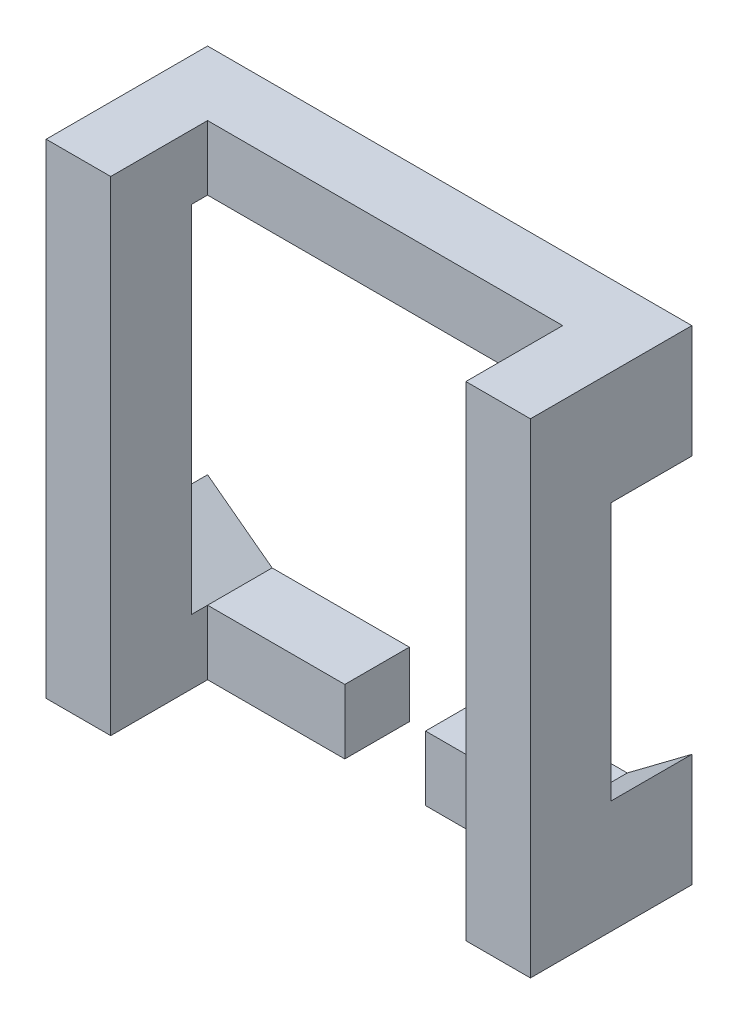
ISO-10303-21;
HEADER;
FILE_DESCRIPTION(('STEP AP214'),'2;1');
FILE_NAME('part.step','',(''),(''),'','','');
FILE_SCHEMA(('AUTOMOTIVE_DESIGN { 1 0 10303 214 1 1 1 1 }'));
ENDSEC;
DATA;
#1=APPLICATION_CONTEXT('core data for automotive mechanical design processes');
#2=APPLICATION_PROTOCOL_DEFINITION('international standard','automotive_design',2000,#1);
#3=PRODUCT_CONTEXT('',#1,'mechanical');
#4=PRODUCT('Part','Part','',(#3));
#5=PRODUCT_RELATED_PRODUCT_CATEGORY('part','',(#4));
#6=PRODUCT_DEFINITION_FORMATION('','',#4);
#7=PRODUCT_DEFINITION_CONTEXT('part definition',#1,'design');
#8=PRODUCT_DEFINITION('design','',#6,#7);
#9=PRODUCT_DEFINITION_SHAPE('','',#8);
#10=(LENGTH_UNIT() NAMED_UNIT(*) SI_UNIT(.MILLI.,.METRE.));
#11=(NAMED_UNIT(*) PLANE_ANGLE_UNIT() SI_UNIT($,.RADIAN.));
#12=(NAMED_UNIT(*) SI_UNIT($,.STERADIAN.) SOLID_ANGLE_UNIT());
#13=UNCERTAINTY_MEASURE_WITH_UNIT(LENGTH_MEASURE(1.E-05),#10,'distance_accuracy_value','');
#14=(GEOMETRIC_REPRESENTATION_CONTEXT(3) GLOBAL_UNCERTAINTY_ASSIGNED_CONTEXT((#13)) GLOBAL_UNIT_ASSIGNED_CONTEXT((#10,
#11,#12)) REPRESENTATION_CONTEXT('',''));
#15=CARTESIAN_POINT('',(0.,0.,0.));
#16=DIRECTION('',(0.,0.,1.));
#17=DIRECTION('',(1.,0.,0.));
#18=AXIS2_PLACEMENT_3D('',#15,#16,#17);
#19=CARTESIAN_POINT('',(0.,0.,2.));
#20=DIRECTION('',(0.,1.,0.));
#21=DIRECTION('',(0.,0.,1.));
#22=AXIS2_PLACEMENT_3D('',#19,#20,#21);
#23=PLANE('',#22);
#24=DIRECTION('',(1.,0.,0.));
#25=VECTOR('',#24,1.);
#26=CARTESIAN_POINT('',(0.,0.,0.));
#27=LINE('',#26,#25);
#28=CARTESIAN_POINT('',(0.,0.,0.));
#29=VERTEX_POINT('',#28);
#30=CARTESIAN_POINT('',(2.5,0.,0.));
#31=VERTEX_POINT('',#30);
#32=EDGE_CURVE('E266',#29,#31,#27,.T.);
#33=ORIENTED_EDGE('',*,*,#32,.T.);
#34=DIRECTION('',(0.,0.,-1.));
#35=VECTOR('',#34,1.);
#36=CARTESIAN_POINT('',(2.5,0.,2.001));
#37=LINE('',#36,#35);
#38=CARTESIAN_POINT('',(2.5,0.,0.8));
#39=VERTEX_POINT('',#38);
#40=EDGE_CURVE('E184',#39,#31,#37,.T.);
#41=ORIENTED_EDGE('',*,*,#40,.F.);
#42=DIRECTION('',(1.,0.,0.));
#43=VECTOR('',#42,1.);
#44=CARTESIAN_POINT('',(5.2,0.,0.8));
#45=LINE('',#44,#43);
#46=CARTESIAN_POINT('',(0.8,0.,0.8));
#47=VERTEX_POINT('',#46);
#48=EDGE_CURVE('E328',#47,#39,#45,.T.);
#49=ORIENTED_EDGE('',*,*,#48,.F.);
#50=DIRECTION('',(0.,0.,-1.));
#51=VECTOR('',#50,1.);
#52=CARTESIAN_POINT('',(0.8,0.,2.));
#53=LINE('',#52,#51);
#54=CARTESIAN_POINT('',(0.8,0.,2.));
#55=VERTEX_POINT('',#54);
#56=EDGE_CURVE('E336',#55,#47,#53,.T.);
#57=ORIENTED_EDGE('',*,*,#56,.F.);
#58=DIRECTION('',(1.,0.,0.));
#59=VECTOR('',#58,1.);
#60=CARTESIAN_POINT('',(0.,0.,2.));
#61=LINE('',#60,#59);
#62=CARTESIAN_POINT('',(0.,0.,2.));
#63=VERTEX_POINT('',#62);
#64=EDGE_CURVE('E252',#63,#55,#61,.T.);
#65=ORIENTED_EDGE('',*,*,#64,.F.);
#66=DIRECTION('',(0.,0.,-1.));
#67=VECTOR('',#66,1.);
#68=CARTESIAN_POINT('',(0.,0.,2.));
#69=LINE('',#68,#67);
#70=EDGE_CURVE('E280',#63,#29,#69,.T.);
#71=ORIENTED_EDGE('',*,*,#70,.T.);
#72=EDGE_LOOP('',(#33,#41,#49,#57,#65,#71));
#73=FACE_BOUND('',#72,.T.);
#74=ADVANCED_FACE('F34',(#73),#23,.F.);
#75=CARTESIAN_POINT('',(0.,0.,0.));
#76=DIRECTION('',(0.,0.,-1.));
#77=DIRECTION('',(-1.,0.,0.));
#78=AXIS2_PLACEMENT_3D('',#75,#76,#77);
#79=PLANE('',#78);
#80=DIRECTION('',(0.,1.,0.));
#81=VECTOR('',#80,1.);
#82=CARTESIAN_POINT('',(2.5,0.8,0.));
#83=LINE('',#82,#81);
#84=CARTESIAN_POINT('',(2.5,0.8,0.));
#85=VERTEX_POINT('',#84);
#86=EDGE_CURVE('E181',#31,#85,#83,.T.);
#87=ORIENTED_EDGE('',*,*,#86,.F.);
#88=ORIENTED_EDGE('',*,*,#32,.F.);
#89=DIRECTION('',(0.,-1.,0.));
#90=VECTOR('',#89,1.);
#91=CARTESIAN_POINT('',(0.,0.,0.));
#92=LINE('',#91,#90);
#93=CARTESIAN_POINT('',(0.,1.4,0.));
#94=VERTEX_POINT('',#93);
#95=EDGE_CURVE('E223',#94,#29,#92,.T.);
#96=ORIENTED_EDGE('',*,*,#95,.F.);
#97=DIRECTION('',(-0.8,0.6,0.));
#98=VECTOR('',#97,1.);
#99=CARTESIAN_POINT('',(0.8,0.8,0.));
#100=LINE('',#99,#98);
#101=CARTESIAN_POINT('',(0.8,0.8,0.));
#102=VERTEX_POINT('',#101);
#103=EDGE_CURVE('E202',#102,#94,#100,.T.);
#104=ORIENTED_EDGE('',*,*,#103,.F.);
#105=DIRECTION('',(-1.,0.,0.));
#106=VECTOR('',#105,1.);
#107=CARTESIAN_POINT('',(5.2,0.8,0.));
#108=LINE('',#107,#106);
#109=EDGE_CURVE('E195',#85,#102,#108,.T.);
#110=ORIENTED_EDGE('',*,*,#109,.F.);
#111=EDGE_LOOP('',(#87,#88,#96,#104,#110));
#112=FACE_BOUND('',#111,.T.);
#113=ADVANCED_FACE('F200',(#112),#79,.T.);
#114=CARTESIAN_POINT('',(5.2,0.8,1.));
#115=DIRECTION('',(0.,-1.,0.));
#116=DIRECTION('',(0.,0.,-1.));
#117=AXIS2_PLACEMENT_3D('',#114,#115,#116);
#118=PLANE('',#117);
#119=DIRECTION('',(1.,0.,0.));
#120=VECTOR('',#119,1.);
#121=CARTESIAN_POINT('',(5.2,0.8,0.8));
#122=LINE('',#121,#120);
#123=CARTESIAN_POINT('',(0.8,0.8,0.8));
#124=VERTEX_POINT('',#123);
#125=CARTESIAN_POINT('',(2.5,0.8,0.8));
#126=VERTEX_POINT('',#125);
#127=EDGE_CURVE('E11',#124,#126,#122,.T.);
#128=ORIENTED_EDGE('',*,*,#127,.T.);
#129=DIRECTION('',(0.,0.,-1.));
#130=VECTOR('',#129,1.);
#131=CARTESIAN_POINT('',(2.5,0.8,2.001));
#132=LINE('',#131,#130);
#133=EDGE_CURVE('E49',#126,#85,#132,.T.);
#134=ORIENTED_EDGE('',*,*,#133,.T.);
#135=ORIENTED_EDGE('',*,*,#109,.T.);
#136=DIRECTION('',(0.,0.,-1.));
#137=VECTOR('',#136,1.);
#138=CARTESIAN_POINT('',(0.8,0.8,1.));
#139=LINE('',#138,#137);
#140=EDGE_CURVE('E236',#124,#102,#139,.T.);
#141=ORIENTED_EDGE('',*,*,#140,.F.);
#142=EDGE_LOOP('',(#128,#134,#135,#141));
#143=FACE_BOUND('',#142,.T.);
#144=ADVANCED_FACE('F193',(#143),#118,.F.);
#145=CARTESIAN_POINT('',(5.2,6.,0.8));
#146=DIRECTION('',(0.,0.,-1.));
#147=DIRECTION('',(-1.,0.,0.));
#148=AXIS2_PLACEMENT_3D('',#145,#146,#147);
#149=PLANE('',#148);
#150=ORIENTED_EDGE('',*,*,#48,.T.);
#151=DIRECTION('',(0.,-1.,0.));
#152=VECTOR('',#151,1.);
#153=CARTESIAN_POINT('',(2.5,0.8,0.8));
#154=LINE('',#153,#152);
#155=EDGE_CURVE('E190',#126,#39,#154,.T.);
#156=ORIENTED_EDGE('',*,*,#155,.F.);
#157=ORIENTED_EDGE('',*,*,#127,.F.);
#158=DIRECTION('',(0.,-1.,0.));
#159=VECTOR('',#158,1.);
#160=CARTESIAN_POINT('',(0.8,6.,0.8));
#161=LINE('',#160,#159);
#162=EDGE_CURVE('E334',#124,#47,#161,.T.);
#163=ORIENTED_EDGE('',*,*,#162,.T.);
#164=EDGE_LOOP('',(#150,#156,#157,#163));
#165=FACE_BOUND('',#164,.T.);
#166=ADVANCED_FACE('F451',(#165),#149,.F.);
#167=CARTESIAN_POINT('',(0.,0.,2.));
#168=DIRECTION('',(0.,0.,-1.));
#169=DIRECTION('',(-1.,0.,0.));
#170=AXIS2_PLACEMENT_3D('',#167,#168,#169);
#171=PLANE('',#170);
#172=DIRECTION('',(-1.,0.,0.));
#173=VECTOR('',#172,1.);
#174=CARTESIAN_POINT('',(0.,6.,2.));
#175=LINE('',#174,#173);
#176=CARTESIAN_POINT('',(6.,6.,2.));
#177=VERTEX_POINT('',#176);
#178=CARTESIAN_POINT('',(5.2,6.,2.));
#179=VERTEX_POINT('',#178);
#180=EDGE_CURVE('E258',#177,#179,#175,.T.);
#181=ORIENTED_EDGE('',*,*,#180,.T.);
#182=DIRECTION('',(0.,-1.,0.));
#183=VECTOR('',#182,1.);
#184=CARTESIAN_POINT('',(5.2,0.8,2.));
#185=LINE('',#184,#183);
#186=CARTESIAN_POINT('',(5.2,0.,2.));
#187=VERTEX_POINT('',#186);
#188=EDGE_CURVE('E350',#179,#187,#185,.T.);
#189=ORIENTED_EDGE('',*,*,#188,.T.);
#190=CARTESIAN_POINT('',(6.,0.,2.));
#191=VERTEX_POINT('',#190);
#192=EDGE_CURVE('E250',#187,#191,#61,.T.);
#193=ORIENTED_EDGE('',*,*,#192,.T.);
#194=DIRECTION('',(0.,1.,0.));
#195=VECTOR('',#194,1.);
#196=CARTESIAN_POINT('',(6.,0.,2.));
#197=LINE('',#196,#195);
#198=EDGE_CURVE('E255',#191,#177,#197,.T.);
#199=ORIENTED_EDGE('',*,*,#198,.T.);
#200=EDGE_LOOP('',(#181,#189,#193,#199));
#201=FACE_BOUND('',#200,.T.);
#202=ADVANCED_FACE('F404',(#201),#171,.F.);
#203=CARTESIAN_POINT('',(0.,0.,1.));
#204=DIRECTION('',(0.,0.,1.));
#205=DIRECTION('',(1.,0.,0.));
#206=AXIS2_PLACEMENT_3D('',#203,#204,#205);
#207=PLANE('',#206);
#208=DIRECTION('',(0.8,0.6,0.));
#209=VECTOR('',#208,1.);
#210=CARTESIAN_POINT('',(0.8,5.2,1.));
#211=LINE('',#210,#209);
#212=CARTESIAN_POINT('',(0.,4.6,1.));
#213=VERTEX_POINT('',#212);
#214=CARTESIAN_POINT('',(0.8,5.2,1.));
#215=VERTEX_POINT('',#214);
#216=EDGE_CURVE('E246',#213,#215,#211,.T.);
#217=ORIENTED_EDGE('',*,*,#216,.T.);
#218=DIRECTION('',(0.,1.,0.));
#219=VECTOR('',#218,1.);
#220=CARTESIAN_POINT('',(0.8,0.8,1.));
#221=LINE('',#220,#219);
#222=CARTESIAN_POINT('',(0.8,0.8,1.));
#223=VERTEX_POINT('',#222);
#224=EDGE_CURVE('E347',#223,#215,#221,.T.);
#225=ORIENTED_EDGE('',*,*,#224,.F.);
#226=DIRECTION('',(-0.8,0.6,0.));
#227=VECTOR('',#226,1.);
#228=CARTESIAN_POINT('',(0.8,0.8,1.));
#229=LINE('',#228,#227);
#230=CARTESIAN_POINT('',(0.,1.4,1.));
#231=VERTEX_POINT('',#230);
#232=EDGE_CURVE('E361',#223,#231,#229,.T.);
#233=ORIENTED_EDGE('',*,*,#232,.T.);
#234=DIRECTION('',(0.,1.,0.));
#235=VECTOR('',#234,1.);
#236=CARTESIAN_POINT('',(0.,4.6,1.));
#237=LINE('',#236,#235);
#238=EDGE_CURVE('E364',#231,#213,#237,.T.);
#239=ORIENTED_EDGE('',*,*,#238,.T.);
#240=EDGE_LOOP('',(#217,#225,#233,#239));
#241=FACE_BOUND('',#240,.T.);
#242=ADVANCED_FACE('F428',(#241),#207,.F.);
#243=DIRECTION('',(0.8,-0.6,0.));
#244=VECTOR('',#243,1.);
#245=CARTESIAN_POINT('',(5.2,5.2,0.));
#246=LINE('',#245,#244);
#247=CARTESIAN_POINT('',(5.2,5.2,0.));
#248=VERTEX_POINT('',#247);
#249=CARTESIAN_POINT('',(6.,4.6,0.));
#250=VERTEX_POINT('',#249);
#251=EDGE_CURVE('E208',#248,#250,#246,.T.);
#252=ORIENTED_EDGE('',*,*,#251,.F.);
#253=DIRECTION('',(1.,0.,0.));
#254=VECTOR('',#253,1.);
#255=CARTESIAN_POINT('',(5.2,5.2,0.));
#256=LINE('',#255,#254);
#257=CARTESIAN_POINT('',(0.8,5.2,0.));
#258=VERTEX_POINT('',#257);
#259=EDGE_CURVE('E216',#258,#248,#256,.T.);
#260=ORIENTED_EDGE('',*,*,#259,.F.);
#261=DIRECTION('',(0.8,0.6,0.));
#262=VECTOR('',#261,1.);
#263=CARTESIAN_POINT('',(0.8,5.2,0.));
#264=LINE('',#263,#262);
#265=CARTESIAN_POINT('',(0.,4.6,0.));
#266=VERTEX_POINT('',#265);
#267=EDGE_CURVE('E213',#266,#258,#264,.T.);
#268=ORIENTED_EDGE('',*,*,#267,.F.);
#269=CARTESIAN_POINT('',(0.,6.,0.));
#270=VERTEX_POINT('',#269);
#271=EDGE_CURVE('E262',#270,#266,#92,.T.);
#272=ORIENTED_EDGE('',*,*,#271,.F.);
#273=DIRECTION('',(-1.,0.,0.));
#274=VECTOR('',#273,1.);
#275=CARTESIAN_POINT('',(0.,6.,0.));
#276=LINE('',#275,#274);
#277=CARTESIAN_POINT('',(6.,6.,0.));
#278=VERTEX_POINT('',#277);
#279=EDGE_CURVE('E251',#278,#270,#276,.T.);
#280=ORIENTED_EDGE('',*,*,#279,.F.);
#281=DIRECTION('',(0.,1.,0.));
#282=VECTOR('',#281,1.);
#283=CARTESIAN_POINT('',(6.,0.,0.));
#284=LINE('',#283,#282);
#285=EDGE_CURVE('E268',#250,#278,#284,.T.);
#286=ORIENTED_EDGE('',*,*,#285,.F.);
#287=EDGE_LOOP('',(#252,#260,#268,#272,#280,#286));
#288=FACE_BOUND('',#287,.T.);
#289=ADVANCED_FACE('F381',(#288),#79,.T.);
#290=CARTESIAN_POINT('',(0.,0.,2.));
#291=DIRECTION('',(1.,0.,0.));
#292=DIRECTION('',(0.,0.,-1.));
#293=AXIS2_PLACEMENT_3D('',#290,#291,#292);
#294=PLANE('',#293);
#295=ORIENTED_EDGE('',*,*,#271,.T.);
#296=DIRECTION('',(0.,0.,-1.));
#297=VECTOR('',#296,1.);
#298=CARTESIAN_POINT('',(0.,4.6,1.));
#299=LINE('',#298,#297);
#300=EDGE_CURVE('E228',#213,#266,#299,.T.);
#301=ORIENTED_EDGE('',*,*,#300,.F.);
#302=ORIENTED_EDGE('',*,*,#238,.F.);
#303=DIRECTION('',(0.,0.,-1.));
#304=VECTOR('',#303,1.);
#305=CARTESIAN_POINT('',(0.,1.4,1.));
#306=LINE('',#305,#304);
#307=EDGE_CURVE('E230',#231,#94,#306,.T.);
#308=ORIENTED_EDGE('',*,*,#307,.T.);
#309=ORIENTED_EDGE('',*,*,#95,.T.);
#310=ORIENTED_EDGE('',*,*,#70,.F.);
#311=DIRECTION('',(0.,-1.,0.));
#312=VECTOR('',#311,1.);
#313=CARTESIAN_POINT('',(0.,0.,2.));
#314=LINE('',#313,#312);
#315=CARTESIAN_POINT('',(0.,6.,2.));
#316=VERTEX_POINT('',#315);
#317=EDGE_CURVE('E247',#316,#63,#314,.T.);
#318=ORIENTED_EDGE('',*,*,#317,.F.);
#319=DIRECTION('',(0.,0.,-1.));
#320=VECTOR('',#319,1.);
#321=CARTESIAN_POINT('',(0.,6.,2.));
#322=LINE('',#321,#320);
#323=EDGE_CURVE('E261',#316,#270,#322,.T.);
#324=ORIENTED_EDGE('',*,*,#323,.T.);
#325=EDGE_LOOP('',(#295,#301,#302,#308,#309,#310,#318,#324));
#326=FACE_BOUND('',#325,.T.);
#327=ADVANCED_FACE('F36',(#326),#294,.F.);
#328=CARTESIAN_POINT('',(3.5,0.,0.8));
#329=VERTEX_POINT('',#328);
#330=CARTESIAN_POINT('',(5.2,0.,0.8));
#331=VERTEX_POINT('',#330);
#332=EDGE_CURVE('E304',#329,#331,#45,.T.);
#333=ORIENTED_EDGE('',*,*,#332,.F.);
#334=DIRECTION('',(0.,0.,-1.));
#335=VECTOR('',#334,1.);
#336=CARTESIAN_POINT('',(3.5,0.,2.001));
#337=LINE('',#336,#335);
#338=CARTESIAN_POINT('',(3.5,0.,0.));
#339=VERTEX_POINT('',#338);
#340=EDGE_CURVE('E57',#329,#339,#337,.T.);
#341=ORIENTED_EDGE('',*,*,#340,.T.);
#342=CARTESIAN_POINT('',(6.,0.,0.));
#343=VERTEX_POINT('',#342);
#344=EDGE_CURVE('E265',#339,#343,#27,.T.);
#345=ORIENTED_EDGE('',*,*,#344,.T.);
#346=DIRECTION('',(0.,0.,-1.));
#347=VECTOR('',#346,1.);
#348=CARTESIAN_POINT('',(6.,0.,2.));
#349=LINE('',#348,#347);
#350=EDGE_CURVE('E278',#191,#343,#349,.T.);
#351=ORIENTED_EDGE('',*,*,#350,.F.);
#352=ORIENTED_EDGE('',*,*,#192,.F.);
#353=DIRECTION('',(0.,0.,1.));
#354=VECTOR('',#353,1.);
#355=CARTESIAN_POINT('',(5.2,0.,2.));
#356=LINE('',#355,#354);
#357=EDGE_CURVE('E321',#331,#187,#356,.T.);
#358=ORIENTED_EDGE('',*,*,#357,.F.);
#359=EDGE_LOOP('',(#333,#341,#345,#351,#352,#358));
#360=FACE_BOUND('',#359,.T.);
#361=ADVANCED_FACE('F409',(#360),#23,.F.);
#362=CARTESIAN_POINT('',(6.,0.,2.));
#363=DIRECTION('',(-1.,0.,0.));
#364=DIRECTION('',(0.,0.,1.));
#365=AXIS2_PLACEMENT_3D('',#362,#363,#364);
#366=PLANE('',#365);
#367=DIRECTION('',(0.,-1.,0.));
#368=VECTOR('',#367,1.);
#369=CARTESIAN_POINT('',(6.,4.6,1.));
#370=LINE('',#369,#368);
#371=CARTESIAN_POINT('',(6.,4.6,1.));
#372=VERTEX_POINT('',#371);
#373=CARTESIAN_POINT('',(6.,1.4,1.));
#374=VERTEX_POINT('',#373);
#375=EDGE_CURVE('E356',#372,#374,#370,.T.);
#376=ORIENTED_EDGE('',*,*,#375,.F.);
#377=DIRECTION('',(0.,0.,-1.));
#378=VECTOR('',#377,1.);
#379=CARTESIAN_POINT('',(6.,4.6,1.));
#380=LINE('',#379,#378);
#381=EDGE_CURVE('E243',#372,#250,#380,.T.);
#382=ORIENTED_EDGE('',*,*,#381,.T.);
#383=ORIENTED_EDGE('',*,*,#285,.T.);
#384=DIRECTION('',(0.,0.,-1.));
#385=VECTOR('',#384,1.);
#386=CARTESIAN_POINT('',(6.,6.,2.));
#387=LINE('',#386,#385);
#388=EDGE_CURVE('E275',#177,#278,#387,.T.);
#389=ORIENTED_EDGE('',*,*,#388,.F.);
#390=ORIENTED_EDGE('',*,*,#198,.F.);
#391=ORIENTED_EDGE('',*,*,#350,.T.);
#392=CARTESIAN_POINT('',(6.,1.4,0.));
#393=VERTEX_POINT('',#392);
#394=EDGE_CURVE('E269',#343,#393,#284,.T.);
#395=ORIENTED_EDGE('',*,*,#394,.T.);
#396=DIRECTION('',(0.,0.,-1.));
#397=VECTOR('',#396,1.);
#398=CARTESIAN_POINT('',(6.,1.4,1.));
#399=LINE('',#398,#397);
#400=EDGE_CURVE('E241',#374,#393,#399,.T.);
#401=ORIENTED_EDGE('',*,*,#400,.F.);
#402=EDGE_LOOP('',(#376,#382,#383,#389,#390,#391,#395,#401));
#403=FACE_BOUND('',#402,.T.);
#404=ADVANCED_FACE('F378',(#403),#366,.F.);
#405=CARTESIAN_POINT('',(0.,6.,2.));
#406=DIRECTION('',(0.,-1.,0.));
#407=DIRECTION('',(0.,0.,-1.));
#408=AXIS2_PLACEMENT_3D('',#405,#406,#407);
#409=PLANE('',#408);
#410=DIRECTION('',(1.,0.,0.));
#411=VECTOR('',#410,1.);
#412=CARTESIAN_POINT('',(5.2,6.,0.8));
#413=LINE('',#412,#411);
#414=CARTESIAN_POINT('',(0.8,6.,0.8));
#415=VERTEX_POINT('',#414);
#416=CARTESIAN_POINT('',(5.2,6.,0.8));
#417=VERTEX_POINT('',#416);
#418=EDGE_CURVE('E331',#415,#417,#413,.T.);
#419=ORIENTED_EDGE('',*,*,#418,.T.);
#420=DIRECTION('',(0.,0.,1.));
#421=VECTOR('',#420,1.);
#422=CARTESIAN_POINT('',(5.2,6.,2.));
#423=LINE('',#422,#421);
#424=EDGE_CURVE('E324',#417,#179,#423,.T.);
#425=ORIENTED_EDGE('',*,*,#424,.T.);
#426=ORIENTED_EDGE('',*,*,#180,.F.);
#427=ORIENTED_EDGE('',*,*,#388,.T.);
#428=ORIENTED_EDGE('',*,*,#279,.T.);
#429=ORIENTED_EDGE('',*,*,#323,.F.);
#430=CARTESIAN_POINT('',(0.8,6.,2.));
#431=VERTEX_POINT('',#430);
#432=EDGE_CURVE('E257',#431,#316,#175,.T.);
#433=ORIENTED_EDGE('',*,*,#432,.F.);
#434=DIRECTION('',(0.,0.,-1.));
#435=VECTOR('',#434,1.);
#436=CARTESIAN_POINT('',(0.8,6.,2.));
#437=LINE('',#436,#435);
#438=EDGE_CURVE('E327',#431,#415,#437,.T.);
#439=ORIENTED_EDGE('',*,*,#438,.T.);
#440=EDGE_LOOP('',(#419,#425,#426,#427,#428,#429,#433,#439));
#441=FACE_BOUND('',#440,.T.);
#442=ADVANCED_FACE('F386',(#441),#409,.F.);
#443=ORIENTED_EDGE('',*,*,#64,.T.);
#444=DIRECTION('',(0.,1.,0.));
#445=VECTOR('',#444,1.);
#446=CARTESIAN_POINT('',(0.8,0.8,2.));
#447=LINE('',#446,#445);
#448=EDGE_CURVE('E348',#55,#431,#447,.T.);
#449=ORIENTED_EDGE('',*,*,#448,.T.);
#450=ORIENTED_EDGE('',*,*,#432,.T.);
#451=ORIENTED_EDGE('',*,*,#317,.T.);
#452=EDGE_LOOP('',(#443,#449,#450,#451));
#453=FACE_BOUND('',#452,.T.);
#454=ADVANCED_FACE('F393',(#453),#171,.F.);
#455=DIRECTION('',(0.,-1.,0.));
#456=VECTOR('',#455,1.);
#457=CARTESIAN_POINT('',(3.5,0.8,0.));
#458=LINE('',#457,#456);
#459=CARTESIAN_POINT('',(3.5,0.8,0.));
#460=VERTEX_POINT('',#459);
#461=EDGE_CURVE('E189',#460,#339,#458,.T.);
#462=ORIENTED_EDGE('',*,*,#461,.F.);
#463=CARTESIAN_POINT('',(5.2,0.8,0.));
#464=VERTEX_POINT('',#463);
#465=EDGE_CURVE('E203',#464,#460,#108,.T.);
#466=ORIENTED_EDGE('',*,*,#465,.F.);
#467=DIRECTION('',(-0.8,-0.6,0.));
#468=VECTOR('',#467,1.);
#469=CARTESIAN_POINT('',(5.2,0.8,0.));
#470=LINE('',#469,#468);
#471=EDGE_CURVE('E204',#393,#464,#470,.T.);
#472=ORIENTED_EDGE('',*,*,#471,.F.);
#473=ORIENTED_EDGE('',*,*,#394,.F.);
#474=ORIENTED_EDGE('',*,*,#344,.F.);
#475=EDGE_LOOP('',(#462,#466,#472,#473,#474));
#476=FACE_BOUND('',#475,.T.);
#477=ADVANCED_FACE('F315',(#476),#79,.T.);
#478=CARTESIAN_POINT('',(5.2,5.2,1.));
#479=DIRECTION('',(0.6,0.8,0.));
#480=DIRECTION('',(-0.8,0.6,0.));
#481=AXIS2_PLACEMENT_3D('',#478,#479,#480);
#482=PLANE('',#481);
#483=ORIENTED_EDGE('',*,*,#251,.T.);
#484=ORIENTED_EDGE('',*,*,#381,.F.);
#485=DIRECTION('',(0.8,-0.6,0.));
#486=VECTOR('',#485,1.);
#487=CARTESIAN_POINT('',(5.2,5.2,1.));
#488=LINE('',#487,#486);
#489=CARTESIAN_POINT('',(5.2,5.2,1.));
#490=VERTEX_POINT('',#489);
#491=EDGE_CURVE('E219',#490,#372,#488,.T.);
#492=ORIENTED_EDGE('',*,*,#491,.F.);
#493=DIRECTION('',(0.,0.,-1.));
#494=VECTOR('',#493,1.);
#495=CARTESIAN_POINT('',(5.2,5.2,1.));
#496=LINE('',#495,#494);
#497=CARTESIAN_POINT('',(5.2,5.2,0.8));
#498=VERTEX_POINT('',#497);
#499=EDGE_CURVE('E220',#490,#498,#496,.T.);
#500=ORIENTED_EDGE('',*,*,#499,.T.);
#501=EDGE_CURVE('E224',#498,#248,#496,.T.);
#502=ORIENTED_EDGE('',*,*,#501,.T.);
#503=EDGE_LOOP('',(#483,#484,#492,#500,#502));
#504=FACE_BOUND('',#503,.T.);
#505=ADVANCED_FACE('F370',(#504),#482,.F.);
#506=CARTESIAN_POINT('',(5.2,5.2,1.));
#507=DIRECTION('',(0.,1.,0.));
#508=DIRECTION('',(0.,0.,1.));
#509=AXIS2_PLACEMENT_3D('',#506,#507,#508);
#510=PLANE('',#509);
#511=ORIENTED_EDGE('',*,*,#501,.F.);
#512=DIRECTION('',(-1.,0.,0.));
#513=VECTOR('',#512,1.);
#514=CARTESIAN_POINT('',(5.2,5.2,0.8));
#515=LINE('',#514,#513);
#516=CARTESIAN_POINT('',(0.8,5.2,0.8));
#517=VERTEX_POINT('',#516);
#518=EDGE_CURVE('E342',#498,#517,#515,.T.);
#519=ORIENTED_EDGE('',*,*,#518,.T.);
#520=DIRECTION('',(0.,0.,-1.));
#521=VECTOR('',#520,1.);
#522=CARTESIAN_POINT('',(0.8,5.2,1.));
#523=LINE('',#522,#521);
#524=EDGE_CURVE('E227',#517,#258,#523,.T.);
#525=ORIENTED_EDGE('',*,*,#524,.T.);
#526=ORIENTED_EDGE('',*,*,#259,.T.);
#527=EDGE_LOOP('',(#511,#519,#525,#526));
#528=FACE_BOUND('',#527,.T.);
#529=ADVANCED_FACE('F434',(#528),#510,.F.);
#530=CARTESIAN_POINT('',(0.8,5.2,1.));
#531=DIRECTION('',(-0.6,0.8,0.));
#532=DIRECTION('',(-0.8,-0.6,0.));
#533=AXIS2_PLACEMENT_3D('',#530,#531,#532);
#534=PLANE('',#533);
#535=ORIENTED_EDGE('',*,*,#267,.T.);
#536=ORIENTED_EDGE('',*,*,#524,.F.);
#537=EDGE_CURVE('E225',#215,#517,#523,.T.);
#538=ORIENTED_EDGE('',*,*,#537,.F.);
#539=ORIENTED_EDGE('',*,*,#216,.F.);
#540=ORIENTED_EDGE('',*,*,#300,.T.);
#541=EDGE_LOOP('',(#535,#536,#538,#539,#540));
#542=FACE_BOUND('',#541,.T.);
#543=ADVANCED_FACE('F432',(#542),#534,.F.);
#544=CARTESIAN_POINT('',(0.8,0.8,1.));
#545=DIRECTION('',(-0.6,-0.8,0.));
#546=DIRECTION('',(0.8,-0.6,0.));
#547=AXIS2_PLACEMENT_3D('',#544,#545,#546);
#548=PLANE('',#547);
#549=ORIENTED_EDGE('',*,*,#103,.T.);
#550=ORIENTED_EDGE('',*,*,#307,.F.);
#551=ORIENTED_EDGE('',*,*,#232,.F.);
#552=EDGE_CURVE('E233',#223,#124,#139,.T.);
#553=ORIENTED_EDGE('',*,*,#552,.T.);
#554=ORIENTED_EDGE('',*,*,#140,.T.);
#555=EDGE_LOOP('',(#549,#550,#551,#553,#554));
#556=FACE_BOUND('',#555,.T.);
#557=ADVANCED_FACE('F425',(#556),#548,.F.);
#558=ORIENTED_EDGE('',*,*,#465,.T.);
#559=DIRECTION('',(0.,0.,-1.));
#560=VECTOR('',#559,1.);
#561=CARTESIAN_POINT('',(3.5,0.8,2.001));
#562=LINE('',#561,#560);
#563=CARTESIAN_POINT('',(3.5,0.8,0.8));
#564=VERTEX_POINT('',#563);
#565=EDGE_CURVE('E197',#564,#460,#562,.T.);
#566=ORIENTED_EDGE('',*,*,#565,.F.);
#567=CARTESIAN_POINT('',(5.2,0.8,0.8));
#568=VERTEX_POINT('',#567);
#569=EDGE_CURVE('E42',#564,#568,#122,.T.);
#570=ORIENTED_EDGE('',*,*,#569,.T.);
#571=DIRECTION('',(0.,0.,-1.));
#572=VECTOR('',#571,1.);
#573=CARTESIAN_POINT('',(5.2,0.8,1.));
#574=LINE('',#573,#572);
#575=EDGE_CURVE('E240',#568,#464,#574,.T.);
#576=ORIENTED_EDGE('',*,*,#575,.T.);
#577=EDGE_LOOP('',(#558,#566,#570,#576));
#578=FACE_BOUND('',#577,.T.);
#579=ADVANCED_FACE('F287',(#578),#118,.F.);
#580=CARTESIAN_POINT('',(5.2,0.8,1.));
#581=DIRECTION('',(0.6,-0.8,0.));
#582=DIRECTION('',(0.8,0.6,0.));
#583=AXIS2_PLACEMENT_3D('',#580,#581,#582);
#584=PLANE('',#583);
#585=ORIENTED_EDGE('',*,*,#471,.T.);
#586=ORIENTED_EDGE('',*,*,#575,.F.);
#587=CARTESIAN_POINT('',(5.2,0.8,1.));
#588=VERTEX_POINT('',#587);
#589=EDGE_CURVE('E237',#588,#568,#574,.T.);
#590=ORIENTED_EDGE('',*,*,#589,.F.);
#591=DIRECTION('',(-0.8,-0.6,0.));
#592=VECTOR('',#591,1.);
#593=CARTESIAN_POINT('',(5.2,0.8,1.));
#594=LINE('',#593,#592);
#595=EDGE_CURVE('E359',#374,#588,#594,.T.);
#596=ORIENTED_EDGE('',*,*,#595,.F.);
#597=ORIENTED_EDGE('',*,*,#400,.T.);
#598=EDGE_LOOP('',(#585,#586,#590,#596,#597));
#599=FACE_BOUND('',#598,.T.);
#600=ADVANCED_FACE('F308',(#599),#584,.F.);
#601=ORIENTED_EDGE('',*,*,#595,.T.);
#602=DIRECTION('',(0.,-1.,0.));
#603=VECTOR('',#602,1.);
#604=CARTESIAN_POINT('',(5.2,0.8,1.));
#605=LINE('',#604,#603);
#606=EDGE_CURVE('E299',#490,#588,#605,.T.);
#607=ORIENTED_EDGE('',*,*,#606,.F.);
#608=ORIENTED_EDGE('',*,*,#491,.T.);
#609=ORIENTED_EDGE('',*,*,#375,.T.);
#610=EDGE_LOOP('',(#601,#607,#608,#609));
#611=FACE_BOUND('',#610,.T.);
#612=ADVANCED_FACE('F436',(#611),#207,.F.);
#613=CARTESIAN_POINT('',(0.8,0.8,2.));
#614=DIRECTION('',(-1.,0.,0.));
#615=DIRECTION('',(0.,0.,1.));
#616=AXIS2_PLACEMENT_3D('',#613,#614,#615);
#617=PLANE('',#616);
#618=ORIENTED_EDGE('',*,*,#224,.T.);
#619=ORIENTED_EDGE('',*,*,#537,.T.);
#620=EDGE_CURVE('E306',#415,#517,#161,.T.);
#621=ORIENTED_EDGE('',*,*,#620,.F.);
#622=ORIENTED_EDGE('',*,*,#438,.F.);
#623=ORIENTED_EDGE('',*,*,#448,.F.);
#624=ORIENTED_EDGE('',*,*,#56,.T.);
#625=ORIENTED_EDGE('',*,*,#162,.F.);
#626=ORIENTED_EDGE('',*,*,#552,.F.);
#627=EDGE_LOOP('',(#618,#619,#621,#622,#623,#624,#625,#626));
#628=FACE_BOUND('',#627,.T.);
#629=ADVANCED_FACE('F397',(#628),#617,.F.);
#630=CARTESIAN_POINT('',(5.2,0.8,2.));
#631=DIRECTION('',(1.,0.,0.));
#632=DIRECTION('',(0.,0.,-1.));
#633=AXIS2_PLACEMENT_3D('',#630,#631,#632);
#634=PLANE('',#633);
#635=ORIENTED_EDGE('',*,*,#606,.T.);
#636=ORIENTED_EDGE('',*,*,#589,.T.);
#637=DIRECTION('',(0.,-1.,0.));
#638=VECTOR('',#637,1.);
#639=CARTESIAN_POINT('',(5.2,6.,0.8));
#640=LINE('',#639,#638);
#641=EDGE_CURVE('E296',#568,#331,#640,.T.);
#642=ORIENTED_EDGE('',*,*,#641,.T.);
#643=ORIENTED_EDGE('',*,*,#357,.T.);
#644=ORIENTED_EDGE('',*,*,#188,.F.);
#645=ORIENTED_EDGE('',*,*,#424,.F.);
#646=EDGE_CURVE('E305',#417,#498,#640,.T.);
#647=ORIENTED_EDGE('',*,*,#646,.T.);
#648=ORIENTED_EDGE('',*,*,#499,.F.);
#649=EDGE_LOOP('',(#635,#636,#642,#643,#644,#645,#647,#648));
#650=FACE_BOUND('',#649,.T.);
#651=ADVANCED_FACE('F294',(#650),#634,.F.);
#652=ORIENTED_EDGE('',*,*,#569,.F.);
#653=DIRECTION('',(0.,1.,0.));
#654=VECTOR('',#653,1.);
#655=CARTESIAN_POINT('',(3.5,0.8,0.8));
#656=LINE('',#655,#654);
#657=EDGE_CURVE('E639',#329,#564,#656,.T.);
#658=ORIENTED_EDGE('',*,*,#657,.F.);
#659=ORIENTED_EDGE('',*,*,#332,.T.);
#660=ORIENTED_EDGE('',*,*,#641,.F.);
#661=EDGE_LOOP('',(#652,#658,#659,#660));
#662=FACE_BOUND('',#661,.T.);
#663=ADVANCED_FACE('F302',(#662),#149,.F.);
#664=ORIENTED_EDGE('',*,*,#646,.F.);
#665=ORIENTED_EDGE('',*,*,#418,.F.);
#666=ORIENTED_EDGE('',*,*,#620,.T.);
#667=ORIENTED_EDGE('',*,*,#518,.F.);
#668=EDGE_LOOP('',(#664,#665,#666,#667));
#669=FACE_BOUND('',#668,.T.);
#670=ADVANCED_FACE('F401',(#669),#149,.F.);
#671=CARTESIAN_POINT('',(3.5,0.8,2.001));
#672=DIRECTION('',(1.,0.,0.));
#673=DIRECTION('',(0.,0.,-1.));
#674=AXIS2_PLACEMENT_3D('',#671,#672,#673);
#675=PLANE('',#674);
#676=ORIENTED_EDGE('',*,*,#657,.T.);
#677=ORIENTED_EDGE('',*,*,#565,.T.);
#678=ORIENTED_EDGE('',*,*,#461,.T.);
#679=ORIENTED_EDGE('',*,*,#340,.F.);
#680=EDGE_LOOP('',(#676,#677,#678,#679));
#681=FACE_BOUND('',#680,.T.);
#682=ADVANCED_FACE('F547',(#681),#675,.F.);
#683=CARTESIAN_POINT('',(2.5,0.8,2.001));
#684=DIRECTION('',(-1.,0.,0.));
#685=DIRECTION('',(0.,0.,1.));
#686=AXIS2_PLACEMENT_3D('',#683,#684,#685);
#687=PLANE('',#686);
#688=ORIENTED_EDGE('',*,*,#155,.T.);
#689=ORIENTED_EDGE('',*,*,#40,.T.);
#690=ORIENTED_EDGE('',*,*,#86,.T.);
#691=ORIENTED_EDGE('',*,*,#133,.F.);
#692=EDGE_LOOP('',(#688,#689,#690,#691));
#693=FACE_BOUND('',#692,.T.);
#694=ADVANCED_FACE('F182',(#693),#687,.F.);
#695=CLOSED_SHELL('',(#74,#113,#144,#166,#202,#242,#289,#327,#361,#404,#442,#454,#477,#505,#529,
#543,#557,#579,#600,#612,#629,#651,#663,#670,#682,#694));
#696=MANIFOLD_SOLID_BREP('B2',#695);
#697=ADVANCED_BREP_SHAPE_REPRESENTATION('',(#18,#696),#14);
#698=SHAPE_DEFINITION_REPRESENTATION(#9,#697);
ENDSEC;
END-ISO-10303-21;
